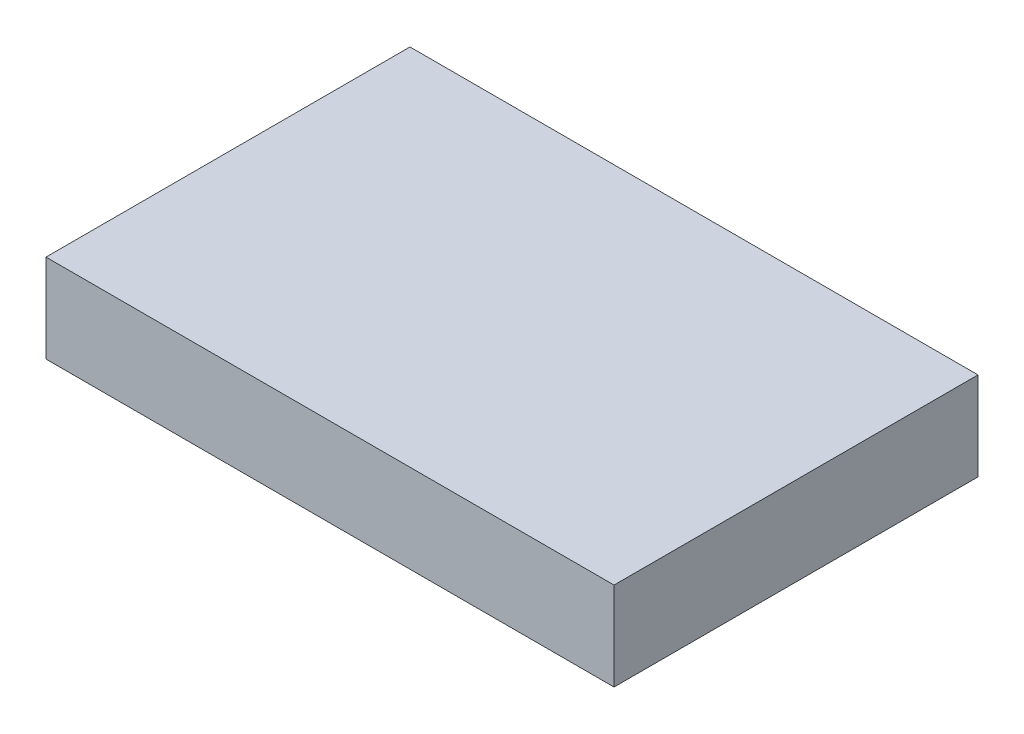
ISO-10303-21;
HEADER;
FILE_DESCRIPTION(('STEP AP214'),'2;1');
FILE_NAME('part.step','',(''),(''),'','','');
FILE_SCHEMA(('AUTOMOTIVE_DESIGN { 1 0 10303 214 1 1 1 1 }'));
ENDSEC;
DATA;
#1=APPLICATION_CONTEXT('core data for automotive mechanical design processes');
#2=APPLICATION_PROTOCOL_DEFINITION('international standard','automotive_design',2000,#1);
#3=PRODUCT_CONTEXT('',#1,'mechanical');
#4=PRODUCT('Part','Part','',(#3));
#5=PRODUCT_RELATED_PRODUCT_CATEGORY('part','',(#4));
#6=PRODUCT_DEFINITION_FORMATION('','',#4);
#7=PRODUCT_DEFINITION_CONTEXT('part definition',#1,'design');
#8=PRODUCT_DEFINITION('design','',#6,#7);
#9=PRODUCT_DEFINITION_SHAPE('','',#8);
#10=(LENGTH_UNIT() NAMED_UNIT(*) SI_UNIT(.MILLI.,.METRE.));
#11=(NAMED_UNIT(*) PLANE_ANGLE_UNIT() SI_UNIT($,.RADIAN.));
#12=(NAMED_UNIT(*) SI_UNIT($,.STERADIAN.) SOLID_ANGLE_UNIT());
#13=UNCERTAINTY_MEASURE_WITH_UNIT(LENGTH_MEASURE(1.E-05),#10,'distance_accuracy_value','');
#14=(GEOMETRIC_REPRESENTATION_CONTEXT(3) GLOBAL_UNCERTAINTY_ASSIGNED_CONTEXT((#13)) GLOBAL_UNIT_ASSIGNED_CONTEXT((#10,
#11,#12)) REPRESENTATION_CONTEXT('',''));
#15=CARTESIAN_POINT('',(0.,0.,0.));
#16=DIRECTION('',(0.,0.,1.));
#17=DIRECTION('',(1.,0.,0.));
#18=AXIS2_PLACEMENT_3D('',#15,#16,#17);
#19=CARTESIAN_POINT('',(-86.7956107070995,27.,-55.6146576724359));
#20=DIRECTION('',(1.,0.,0.));
#21=DIRECTION('',(0.,0.,-1.));
#22=AXIS2_PLACEMENT_3D('',#19,#20,#21);
#23=PLANE('',#22);
#24=DIRECTION('',(0.,0.,1.));
#25=VECTOR('',#24,1.);
#26=CARTESIAN_POINT('',(-86.7956107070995,0.,-55.6146576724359));
#27=LINE('',#26,#25);
#28=CARTESIAN_POINT('',(-86.7956107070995,0.,-55.6146576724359));
#29=VERTEX_POINT('',#28);
#30=CARTESIAN_POINT('',(-86.7956107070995,0.,55.6146576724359));
#31=VERTEX_POINT('',#30);
#32=EDGE_CURVE('E76',#29,#31,#27,.T.);
#33=ORIENTED_EDGE('',*,*,#32,.T.);
#34=DIRECTION('',(0.,-1.,0.));
#35=VECTOR('',#34,1.);
#36=CARTESIAN_POINT('',(-86.7956107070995,27.,55.6146576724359));
#37=LINE('',#36,#35);
#38=CARTESIAN_POINT('',(-86.7956107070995,27.,55.6146576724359));
#39=VERTEX_POINT('',#38);
#40=EDGE_CURVE('E11',#39,#31,#37,.T.);
#41=ORIENTED_EDGE('',*,*,#40,.F.);
#42=DIRECTION('',(0.,0.,1.));
#43=VECTOR('',#42,1.);
#44=CARTESIAN_POINT('',(-86.7956107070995,27.,-55.6146576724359));
#45=LINE('',#44,#43);
#46=CARTESIAN_POINT('',(-86.7956107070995,27.,-55.6146576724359));
#47=VERTEX_POINT('',#46);
#48=EDGE_CURVE('E94',#47,#39,#45,.T.);
#49=ORIENTED_EDGE('',*,*,#48,.F.);
#50=DIRECTION('',(0.,-1.,0.));
#51=VECTOR('',#50,1.);
#52=CARTESIAN_POINT('',(-86.7956107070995,27.,-55.6146576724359));
#53=LINE('',#52,#51);
#54=EDGE_CURVE('E88',#47,#29,#53,.T.);
#55=ORIENTED_EDGE('',*,*,#54,.T.);
#56=EDGE_LOOP('',(#33,#41,#49,#55));
#57=FACE_BOUND('',#56,.T.);
#58=ADVANCED_FACE('F32',(#57),#23,.F.);
#59=CARTESIAN_POINT('',(-86.7956107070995,27.,55.6146576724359));
#60=DIRECTION('',(0.,0.,-1.));
#61=DIRECTION('',(-1.,0.,0.));
#62=AXIS2_PLACEMENT_3D('',#59,#60,#61);
#63=PLANE('',#62);
#64=DIRECTION('',(1.,0.,0.));
#65=VECTOR('',#64,1.);
#66=CARTESIAN_POINT('',(-86.7956107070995,0.,55.6146576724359));
#67=LINE('',#66,#65);
#68=CARTESIAN_POINT('',(86.7956107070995,0.,55.6146576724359));
#69=VERTEX_POINT('',#68);
#70=EDGE_CURVE('E72',#31,#69,#67,.T.);
#71=ORIENTED_EDGE('',*,*,#70,.T.);
#72=DIRECTION('',(0.,-1.,0.));
#73=VECTOR('',#72,1.);
#74=CARTESIAN_POINT('',(86.7956107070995,27.,55.6146576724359));
#75=LINE('',#74,#73);
#76=CARTESIAN_POINT('',(86.7956107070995,27.,55.6146576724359));
#77=VERTEX_POINT('',#76);
#78=EDGE_CURVE('E39',#77,#69,#75,.T.);
#79=ORIENTED_EDGE('',*,*,#78,.F.);
#80=DIRECTION('',(1.,0.,0.));
#81=VECTOR('',#80,1.);
#82=CARTESIAN_POINT('',(-86.7956107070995,27.,55.6146576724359));
#83=LINE('',#82,#81);
#84=EDGE_CURVE('E84',#39,#77,#83,.T.);
#85=ORIENTED_EDGE('',*,*,#84,.F.);
#86=ORIENTED_EDGE('',*,*,#40,.T.);
#87=EDGE_LOOP('',(#71,#79,#85,#86));
#88=FACE_BOUND('',#87,.T.);
#89=ADVANCED_FACE('F83',(#88),#63,.F.);
#90=CARTESIAN_POINT('',(86.7956107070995,27.,-55.6146576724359));
#91=DIRECTION('',(-1.,0.,0.));
#92=DIRECTION('',(0.,0.,1.));
#93=AXIS2_PLACEMENT_3D('',#90,#91,#92);
#94=PLANE('',#93);
#95=DIRECTION('',(0.,0.,-1.));
#96=VECTOR('',#95,1.);
#97=CARTESIAN_POINT('',(86.7956107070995,0.,-55.6146576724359));
#98=LINE('',#97,#96);
#99=CARTESIAN_POINT('',(86.7956107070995,0.,-55.6146576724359));
#100=VERTEX_POINT('',#99);
#101=EDGE_CURVE('E77',#69,#100,#98,.T.);
#102=ORIENTED_EDGE('',*,*,#101,.T.);
#103=DIRECTION('',(0.,-1.,0.));
#104=VECTOR('',#103,1.);
#105=CARTESIAN_POINT('',(86.7956107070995,27.,-55.6146576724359));
#106=LINE('',#105,#104);
#107=CARTESIAN_POINT('',(86.7956107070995,27.,-55.6146576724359));
#108=VERTEX_POINT('',#107);
#109=EDGE_CURVE('E100',#108,#100,#106,.T.);
#110=ORIENTED_EDGE('',*,*,#109,.F.);
#111=DIRECTION('',(0.,0.,-1.));
#112=VECTOR('',#111,1.);
#113=CARTESIAN_POINT('',(86.7956107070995,27.,-55.6146576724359));
#114=LINE('',#113,#112);
#115=EDGE_CURVE('E51',#77,#108,#114,.T.);
#116=ORIENTED_EDGE('',*,*,#115,.F.);
#117=ORIENTED_EDGE('',*,*,#78,.T.);
#118=EDGE_LOOP('',(#102,#110,#116,#117));
#119=FACE_BOUND('',#118,.T.);
#120=ADVANCED_FACE('F103',(#119),#94,.F.);
#121=CARTESIAN_POINT('',(-86.7956107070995,27.,-55.6146576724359));
#122=DIRECTION('',(0.,0.,1.));
#123=DIRECTION('',(1.,0.,0.));
#124=AXIS2_PLACEMENT_3D('',#121,#122,#123);
#125=PLANE('',#124);
#126=DIRECTION('',(-1.,0.,0.));
#127=VECTOR('',#126,1.);
#128=CARTESIAN_POINT('',(-86.7956107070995,0.,-55.6146576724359));
#129=LINE('',#128,#127);
#130=EDGE_CURVE('E92',#100,#29,#129,.T.);
#131=ORIENTED_EDGE('',*,*,#130,.T.);
#132=ORIENTED_EDGE('',*,*,#54,.F.);
#133=DIRECTION('',(-1.,0.,0.));
#134=VECTOR('',#133,1.);
#135=CARTESIAN_POINT('',(-86.7956107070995,27.,-55.6146576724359));
#136=LINE('',#135,#134);
#137=EDGE_CURVE('E46',#108,#47,#136,.T.);
#138=ORIENTED_EDGE('',*,*,#137,.F.);
#139=ORIENTED_EDGE('',*,*,#109,.T.);
#140=EDGE_LOOP('',(#131,#132,#138,#139));
#141=FACE_BOUND('',#140,.T.);
#142=ADVANCED_FACE('F105',(#141),#125,.F.);
#143=CARTESIAN_POINT('',(-86.7956107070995,27.,55.6146576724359));
#144=DIRECTION('',(0.,1.,0.));
#145=DIRECTION('',(0.,0.,1.));
#146=AXIS2_PLACEMENT_3D('',#143,#144,#145);
#147=PLANE('',#146);
#148=ORIENTED_EDGE('',*,*,#48,.T.);
#149=ORIENTED_EDGE('',*,*,#84,.T.);
#150=ORIENTED_EDGE('',*,*,#115,.T.);
#151=ORIENTED_EDGE('',*,*,#137,.T.);
#152=EDGE_LOOP('',(#148,#149,#150,#151));
#153=FACE_BOUND('',#152,.T.);
#154=ADVANCED_FACE('F106',(#153),#147,.T.);
#155=CARTESIAN_POINT('',(-86.7956107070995,0.,55.6146576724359));
#156=DIRECTION('',(0.,1.,0.));
#157=DIRECTION('',(0.,0.,1.));
#158=AXIS2_PLACEMENT_3D('',#155,#156,#157);
#159=PLANE('',#158);
#160=ORIENTED_EDGE('',*,*,#32,.F.);
#161=ORIENTED_EDGE('',*,*,#130,.F.);
#162=ORIENTED_EDGE('',*,*,#101,.F.);
#163=ORIENTED_EDGE('',*,*,#70,.F.);
#164=EDGE_LOOP('',(#160,#161,#162,#163));
#165=FACE_BOUND('',#164,.T.);
#166=ADVANCED_FACE('F73',(#165),#159,.F.);
#167=CLOSED_SHELL('',(#58,#89,#120,#142,#154,#166));
#168=MANIFOLD_SOLID_BREP('B2',#167);
#169=ADVANCED_BREP_SHAPE_REPRESENTATION('',(#18,#168),#14);
#170=SHAPE_DEFINITION_REPRESENTATION(#9,#169);
ENDSEC;
END-ISO-10303-21;
